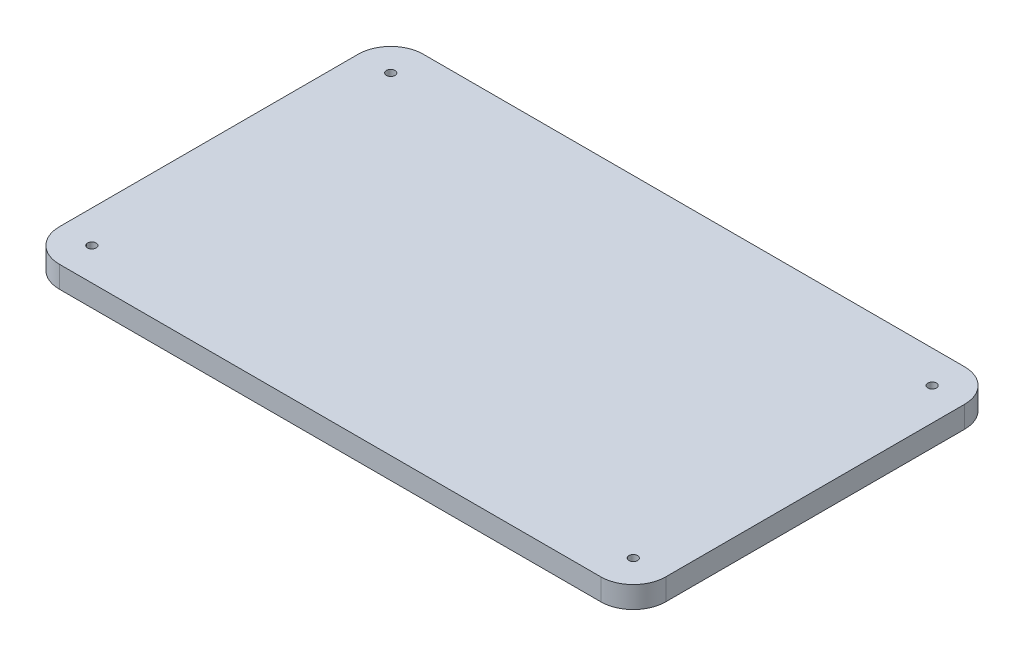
from build123d import *

# Parameters (mm, degrees)
BOSS_EXTRUDE1_DEPTH       = 6.35
F_6_40_TAPPED_HOLE2_D     = 2.54
F_6_40_TAPPED_HOLE2_DEPTH = 8.9154
F_6_40_TAPPED_HOLE2_TIP   = 0.763092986


with BuildPart() as part:
    # Sketch1 → Boss-Extrude1 (new body)
    with BuildSketch(Plane(origin=(0, 0, 0), x_dir=(1, 0, 0), z_dir=(0, 1, 0))):
        with BuildLine():
            Line((88.9, -43.815), (88.9, 43.815))
            ThreePointArc((88.9, 43.815), (86.110192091, 50.550192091), (79.375, 53.34))
            Line((79.375, 53.34), (-79.375, 53.34))
            ThreePointArc((-79.375, 53.34), (-86.110192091, 50.550192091), (-88.9, 43.815))
            Line((-88.9, 43.815), (-88.9, -43.815))
            ThreePointArc((-88.9, -43.815), (-86.110192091, -50.550192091), (-79.375, -53.34))
            Line((-79.375, -53.34), (79.375, -53.34))
            ThreePointArc((79.375, -53.34), (86.110192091, -50.550192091), (88.9, -43.815))
        make_face()
    extrude(amount=BOSS_EXTRUDE1_DEPTH)

    # 6-40 Tapped Hole2
    with Locations(Plane(origin=(79.375, 6.35, -43.815), x_dir=(0, 0, 1), z_dir=(0, 1, 0))):
        with Locations((0, 0), (87.63, 0), (0, -158.75), (87.63, -158.75)):
            Hole(F_6_40_TAPPED_HOLE2_D / 2, depth=F_6_40_TAPPED_HOLE2_DEPTH)
            with Locations((0, 0, -(F_6_40_TAPPED_HOLE2_DEPTH + F_6_40_TAPPED_HOLE2_TIP / 2))):  # 118° drill point
                Cone(0, F_6_40_TAPPED_HOLE2_D / 2, F_6_40_TAPPED_HOLE2_TIP, mode=Mode.SUBTRACT)


solid = part.part
